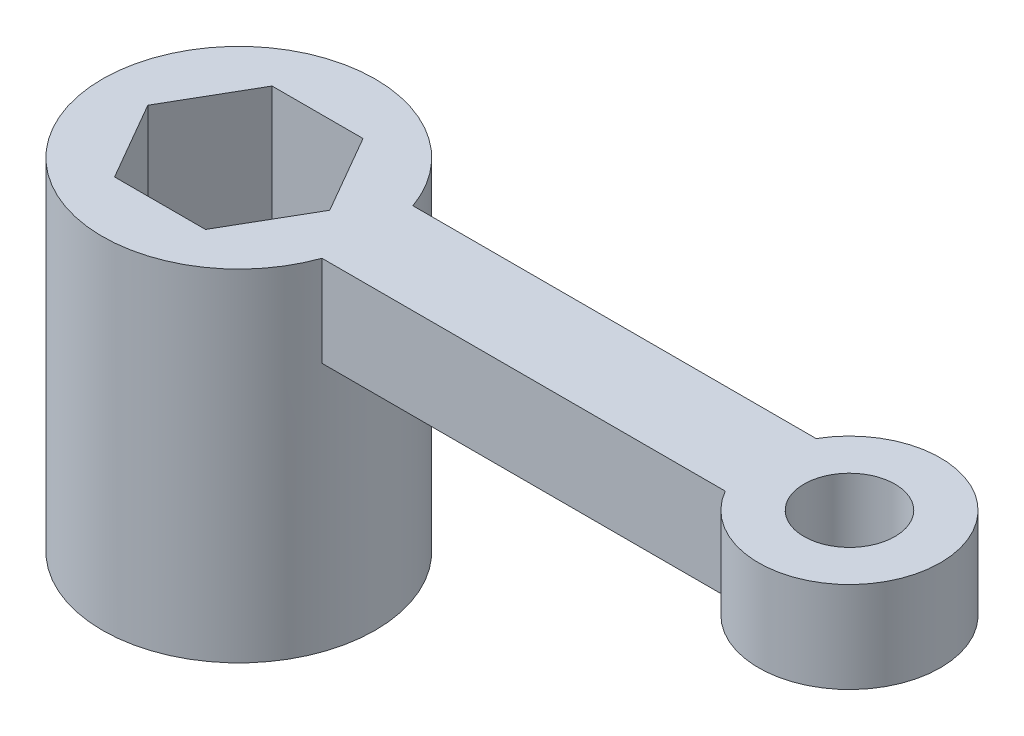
ISO-10303-21;
HEADER;
FILE_DESCRIPTION(('STEP AP214'),'2;1');
FILE_NAME('part.step','',(''),(''),'','','');
FILE_SCHEMA(('AUTOMOTIVE_DESIGN { 1 0 10303 214 1 1 1 1 }'));
ENDSEC;
DATA;
#1=APPLICATION_CONTEXT('core data for automotive mechanical design processes');
#2=APPLICATION_PROTOCOL_DEFINITION('international standard','automotive_design',2000,#1);
#3=PRODUCT_CONTEXT('',#1,'mechanical');
#4=PRODUCT('Part','Part','',(#3));
#5=PRODUCT_RELATED_PRODUCT_CATEGORY('part','',(#4));
#6=PRODUCT_DEFINITION_FORMATION('','',#4);
#7=PRODUCT_DEFINITION_CONTEXT('part definition',#1,'design');
#8=PRODUCT_DEFINITION('design','',#6,#7);
#9=PRODUCT_DEFINITION_SHAPE('','',#8);
#10=(LENGTH_UNIT() NAMED_UNIT(*) SI_UNIT(.MILLI.,.METRE.));
#11=(NAMED_UNIT(*) PLANE_ANGLE_UNIT() SI_UNIT($,.RADIAN.));
#12=(NAMED_UNIT(*) SI_UNIT($,.STERADIAN.) SOLID_ANGLE_UNIT());
#13=UNCERTAINTY_MEASURE_WITH_UNIT(LENGTH_MEASURE(1.E-05),#10,'distance_accuracy_value','');
#14=(GEOMETRIC_REPRESENTATION_CONTEXT(3) GLOBAL_UNCERTAINTY_ASSIGNED_CONTEXT((#13)) GLOBAL_UNIT_ASSIGNED_CONTEXT((#10,
#11,#12)) REPRESENTATION_CONTEXT('',''));
#15=CARTESIAN_POINT('',(0.,0.,0.));
#16=DIRECTION('',(0.,0.,1.));
#17=DIRECTION('',(1.,0.,0.));
#18=AXIS2_PLACEMENT_3D('',#15,#16,#17);
#19=CARTESIAN_POINT('',(0.,0.,0.));
#20=DIRECTION('',(0.,1.,0.));
#21=DIRECTION('',(0.,0.,1.));
#22=AXIS2_PLACEMENT_3D('',#19,#20,#21);
#23=PLANE('',#22);
#24=CARTESIAN_POINT('',(6.71434916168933,0.,0.));
#25=DIRECTION('',(0.,1.,0.));
#26=DIRECTION('',(0.,0.,1.));
#27=AXIS2_PLACEMENT_3D('',#24,#25,#26);
#28=CIRCLE('',#27,0.500000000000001);
#29=CARTESIAN_POINT('',(6.71434916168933,0.,0.500000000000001));
#30=VERTEX_POINT('',#29);
#31=EDGE_CURVE('E124',#30,#30,#28,.T.);
#32=ORIENTED_EDGE('',*,*,#31,.T.);
#33=EDGE_LOOP('',(#32));
#34=FACE_BOUND('',#33,.T.);
#35=CARTESIAN_POINT('',(0.,0.,0.));
#36=DIRECTION('',(0.,-1.,0.));
#37=DIRECTION('',(0.,0.,-1.));
#38=AXIS2_PLACEMENT_3D('',#35,#36,#37);
#39=CIRCLE('',#38,1.5);
#40=CARTESIAN_POINT('',(1.4142135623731,0.,-0.5));
#41=VERTEX_POINT('',#40);
#42=CARTESIAN_POINT('',(1.41421356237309,0.,0.5));
#43=VERTEX_POINT('',#42);
#44=EDGE_CURVE('E72',#41,#43,#39,.T.);
#45=ORIENTED_EDGE('',*,*,#44,.F.);
#46=DIRECTION('',(-1.,0.,0.));
#47=VECTOR('',#46,1.);
#48=CARTESIAN_POINT('',(0.,0.,-0.5));
#49=LINE('',#48,#47);
#50=CARTESIAN_POINT('',(5.8483237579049,0.,-0.5));
#51=VERTEX_POINT('',#50);
#52=EDGE_CURVE('E129',#51,#41,#49,.T.);
#53=ORIENTED_EDGE('',*,*,#52,.F.);
#54=CARTESIAN_POINT('',(6.71434916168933,0.,0.));
#55=DIRECTION('',(0.,1.,0.));
#56=DIRECTION('',(0.,0.,1.));
#57=AXIS2_PLACEMENT_3D('',#54,#55,#56);
#58=CIRCLE('',#57,1.);
#59=CARTESIAN_POINT('',(5.8483237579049,0.,0.5));
#60=VERTEX_POINT('',#59);
#61=EDGE_CURVE('E65',#60,#51,#58,.T.);
#62=ORIENTED_EDGE('',*,*,#61,.F.);
#63=DIRECTION('',(1.,0.,0.));
#64=VECTOR('',#63,1.);
#65=CARTESIAN_POINT('',(0.,0.,0.5));
#66=LINE('',#65,#64);
#67=EDGE_CURVE('E127',#43,#60,#66,.T.);
#68=ORIENTED_EDGE('',*,*,#67,.F.);
#69=EDGE_LOOP('',(#45,#53,#62,#68));
#70=FACE_BOUND('',#69,.T.);
#71=ADVANCED_FACE('F33',(#34,#70),#23,.F.);
#72=CARTESIAN_POINT('',(0.,1.,0.5));
#73=DIRECTION('',(0.,0.,-1.));
#74=DIRECTION('',(-1.,0.,0.));
#75=AXIS2_PLACEMENT_3D('',#72,#73,#74);
#76=PLANE('',#75);
#77=ORIENTED_EDGE('',*,*,#67,.T.);
#78=DIRECTION('',(0.,-1.,0.));
#79=VECTOR('',#78,1.);
#80=CARTESIAN_POINT('',(5.8483237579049,1.,0.5));
#81=LINE('',#80,#79);
#82=CARTESIAN_POINT('',(5.8483237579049,1.,0.5));
#83=VERTEX_POINT('',#82);
#84=EDGE_CURVE('E11',#83,#60,#81,.T.);
#85=ORIENTED_EDGE('',*,*,#84,.F.);
#86=DIRECTION('',(1.,0.,0.));
#87=VECTOR('',#86,1.);
#88=CARTESIAN_POINT('',(0.,1.,0.5));
#89=LINE('',#88,#87);
#90=CARTESIAN_POINT('',(1.41421356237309,1.,0.5));
#91=VERTEX_POINT('',#90);
#92=EDGE_CURVE('E109',#91,#83,#89,.T.);
#93=ORIENTED_EDGE('',*,*,#92,.F.);
#94=DIRECTION('',(0.,-1.,0.));
#95=VECTOR('',#94,1.);
#96=CARTESIAN_POINT('',(1.41421356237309,1.,0.5));
#97=LINE('',#96,#95);
#98=EDGE_CURVE('E146',#91,#43,#97,.T.);
#99=ORIENTED_EDGE('',*,*,#98,.T.);
#100=EDGE_LOOP('',(#77,#85,#93,#99));
#101=FACE_BOUND('',#100,.T.);
#102=ADVANCED_FACE('F196',(#101),#76,.F.);
#103=CARTESIAN_POINT('',(6.71434916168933,1.,0.));
#104=DIRECTION('',(0.,-1.,0.));
#105=DIRECTION('',(0.,0.,-1.));
#106=AXIS2_PLACEMENT_3D('',#103,#104,#105);
#107=CYLINDRICAL_SURFACE('',#106,1.);
#108=ORIENTED_EDGE('',*,*,#61,.T.);
#109=DIRECTION('',(0.,-1.,0.));
#110=VECTOR('',#109,1.);
#111=CARTESIAN_POINT('',(5.8483237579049,1.,-0.5));
#112=LINE('',#111,#110);
#113=CARTESIAN_POINT('',(5.8483237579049,1.,-0.5));
#114=VERTEX_POINT('',#113);
#115=EDGE_CURVE('E43',#114,#51,#112,.T.);
#116=ORIENTED_EDGE('',*,*,#115,.F.);
#117=CARTESIAN_POINT('',(6.71434916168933,1.,0.));
#118=DIRECTION('',(0.,1.,0.));
#119=DIRECTION('',(0.,0.,1.));
#120=AXIS2_PLACEMENT_3D('',#117,#118,#119);
#121=CIRCLE('',#120,1.);
#122=EDGE_CURVE('E103',#83,#114,#121,.T.);
#123=ORIENTED_EDGE('',*,*,#122,.F.);
#124=ORIENTED_EDGE('',*,*,#84,.T.);
#125=EDGE_LOOP('',(#108,#116,#123,#124));
#126=FACE_BOUND('',#125,.T.);
#127=ADVANCED_FACE('F112',(#126),#107,.T.);
#128=CARTESIAN_POINT('',(0.,1.,-0.5));
#129=DIRECTION('',(0.,0.,1.));
#130=DIRECTION('',(1.,0.,0.));
#131=AXIS2_PLACEMENT_3D('',#128,#129,#130);
#132=PLANE('',#131);
#133=ORIENTED_EDGE('',*,*,#52,.T.);
#134=DIRECTION('',(0.,-1.,0.));
#135=VECTOR('',#134,1.);
#136=CARTESIAN_POINT('',(1.41421356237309,1.,-0.5));
#137=LINE('',#136,#135);
#138=CARTESIAN_POINT('',(1.41421356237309,1.,-0.5));
#139=VERTEX_POINT('',#138);
#140=EDGE_CURVE('E116',#139,#41,#137,.T.);
#141=ORIENTED_EDGE('',*,*,#140,.F.);
#142=DIRECTION('',(-1.,0.,0.));
#143=VECTOR('',#142,1.);
#144=CARTESIAN_POINT('',(0.,1.,-0.5));
#145=LINE('',#144,#143);
#146=EDGE_CURVE('E106',#114,#139,#145,.T.);
#147=ORIENTED_EDGE('',*,*,#146,.F.);
#148=ORIENTED_EDGE('',*,*,#115,.T.);
#149=EDGE_LOOP('',(#133,#141,#147,#148));
#150=FACE_BOUND('',#149,.T.);
#151=ADVANCED_FACE('F118',(#150),#132,.F.);
#152=CARTESIAN_POINT('',(0.75,1.,0.433012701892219));
#153=DIRECTION('',(-0.866025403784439,0.,-0.5));
#154=DIRECTION('',(-0.5,0.,0.866025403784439));
#155=AXIS2_PLACEMENT_3D('',#152,#153,#154);
#156=PLANE('',#155);
#157=DIRECTION('',(0.,-1.,0.));
#158=VECTOR('',#157,1.);
#159=CARTESIAN_POINT('',(1.,1.,0.));
#160=LINE('',#159,#158);
#161=CARTESIAN_POINT('',(1.,1.,0.));
#162=VERTEX_POINT('',#161);
#163=CARTESIAN_POINT('',(1.,-2.75,0.));
#164=VERTEX_POINT('',#163);
#165=EDGE_CURVE('E120',#162,#164,#160,.T.);
#166=ORIENTED_EDGE('',*,*,#165,.T.);
#167=DIRECTION('',(-0.5,0.,0.866025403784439));
#168=VECTOR('',#167,1.);
#169=CARTESIAN_POINT('',(0.5,-2.75,0.866025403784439));
#170=LINE('',#169,#168);
#171=CARTESIAN_POINT('',(0.5,-2.75,0.866025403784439));
#172=VERTEX_POINT('',#171);
#173=EDGE_CURVE('E239',#164,#172,#170,.T.);
#174=ORIENTED_EDGE('',*,*,#173,.T.);
#175=DIRECTION('',(0.,-1.,0.));
#176=VECTOR('',#175,1.);
#177=CARTESIAN_POINT('',(0.5,1.,0.866025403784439));
#178=LINE('',#177,#176);
#179=CARTESIAN_POINT('',(0.5,1.,0.866025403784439));
#180=VERTEX_POINT('',#179);
#181=EDGE_CURVE('E81',#180,#172,#178,.T.);
#182=ORIENTED_EDGE('',*,*,#181,.F.);
#183=DIRECTION('',(0.5,0.,-0.866025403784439));
#184=VECTOR('',#183,1.);
#185=CARTESIAN_POINT('',(0.75,1.,0.433012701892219));
#186=LINE('',#185,#184);
#187=EDGE_CURVE('E155',#180,#162,#186,.T.);
#188=ORIENTED_EDGE('',*,*,#187,.T.);
#189=EDGE_LOOP('',(#166,#174,#182,#188));
#190=FACE_BOUND('',#189,.T.);
#191=ADVANCED_FACE('F35',(#190),#156,.T.);
#192=CARTESIAN_POINT('',(0.,1.,0.866025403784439));
#193=DIRECTION('',(0.,0.,-1.));
#194=DIRECTION('',(-1.,0.,0.));
#195=AXIS2_PLACEMENT_3D('',#192,#193,#194);
#196=PLANE('',#195);
#197=ORIENTED_EDGE('',*,*,#181,.T.);
#198=DIRECTION('',(-1.,0.,0.));
#199=VECTOR('',#198,1.);
#200=CARTESIAN_POINT('',(-0.5,-2.75,0.866025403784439));
#201=LINE('',#200,#199);
#202=CARTESIAN_POINT('',(-0.5,-2.75,0.866025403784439));
#203=VERTEX_POINT('',#202);
#204=EDGE_CURVE('E234',#172,#203,#201,.T.);
#205=ORIENTED_EDGE('',*,*,#204,.T.);
#206=DIRECTION('',(0.,-1.,0.));
#207=VECTOR('',#206,1.);
#208=CARTESIAN_POINT('',(-0.5,1.,0.866025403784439));
#209=LINE('',#208,#207);
#210=CARTESIAN_POINT('',(-0.5,1.,0.866025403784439));
#211=VERTEX_POINT('',#210);
#212=EDGE_CURVE('E142',#211,#203,#209,.T.);
#213=ORIENTED_EDGE('',*,*,#212,.F.);
#214=DIRECTION('',(1.,0.,0.));
#215=VECTOR('',#214,1.);
#216=CARTESIAN_POINT('',(0.,1.,0.866025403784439));
#217=LINE('',#216,#215);
#218=EDGE_CURVE('E157',#211,#180,#217,.T.);
#219=ORIENTED_EDGE('',*,*,#218,.T.);
#220=EDGE_LOOP('',(#197,#205,#213,#219));
#221=FACE_BOUND('',#220,.T.);
#222=ADVANCED_FACE('F223',(#221),#196,.T.);
#223=CARTESIAN_POINT('',(-0.75,1.,0.43301270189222));
#224=DIRECTION('',(0.866025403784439,0.,-0.5));
#225=DIRECTION('',(-0.5,0.,-0.866025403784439));
#226=AXIS2_PLACEMENT_3D('',#223,#224,#225);
#227=PLANE('',#226);
#228=ORIENTED_EDGE('',*,*,#212,.T.);
#229=DIRECTION('',(-0.5,0.,-0.866025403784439));
#230=VECTOR('',#229,1.);
#231=CARTESIAN_POINT('',(-1.,-2.75,0.));
#232=LINE('',#231,#230);
#233=CARTESIAN_POINT('',(-1.,-2.75,0.));
#234=VERTEX_POINT('',#233);
#235=EDGE_CURVE('E247',#203,#234,#232,.T.);
#236=ORIENTED_EDGE('',*,*,#235,.T.);
#237=DIRECTION('',(0.,-1.,0.));
#238=VECTOR('',#237,1.);
#239=CARTESIAN_POINT('',(-1.,1.,0.));
#240=LINE('',#239,#238);
#241=CARTESIAN_POINT('',(-1.,1.,0.));
#242=VERTEX_POINT('',#241);
#243=EDGE_CURVE('E139',#242,#234,#240,.T.);
#244=ORIENTED_EDGE('',*,*,#243,.F.);
#245=DIRECTION('',(0.5,0.,0.866025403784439));
#246=VECTOR('',#245,1.);
#247=CARTESIAN_POINT('',(-0.75,1.,0.43301270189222));
#248=LINE('',#247,#246);
#249=EDGE_CURVE('E160',#242,#211,#248,.T.);
#250=ORIENTED_EDGE('',*,*,#249,.T.);
#251=EDGE_LOOP('',(#228,#236,#244,#250));
#252=FACE_BOUND('',#251,.T.);
#253=ADVANCED_FACE('F220',(#252),#227,.T.);
#254=CARTESIAN_POINT('',(-0.75,1.,-0.43301270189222));
#255=DIRECTION('',(0.866025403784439,0.,0.5));
#256=DIRECTION('',(0.5,0.,-0.866025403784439));
#257=AXIS2_PLACEMENT_3D('',#254,#255,#256);
#258=PLANE('',#257);
#259=ORIENTED_EDGE('',*,*,#243,.T.);
#260=DIRECTION('',(0.5,0.,-0.866025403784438));
#261=VECTOR('',#260,1.);
#262=CARTESIAN_POINT('',(-0.5,-2.75,-0.866025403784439));
#263=LINE('',#262,#261);
#264=CARTESIAN_POINT('',(-0.5,-2.75,-0.866025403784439));
#265=VERTEX_POINT('',#264);
#266=EDGE_CURVE('E249',#234,#265,#263,.T.);
#267=ORIENTED_EDGE('',*,*,#266,.T.);
#268=DIRECTION('',(0.,-1.,0.));
#269=VECTOR('',#268,1.);
#270=CARTESIAN_POINT('',(-0.5,1.,-0.866025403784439));
#271=LINE('',#270,#269);
#272=CARTESIAN_POINT('',(-0.5,1.,-0.866025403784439));
#273=VERTEX_POINT('',#272);
#274=EDGE_CURVE('E136',#273,#265,#271,.T.);
#275=ORIENTED_EDGE('',*,*,#274,.F.);
#276=DIRECTION('',(-0.5,0.,0.866025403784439));
#277=VECTOR('',#276,1.);
#278=CARTESIAN_POINT('',(-0.75,1.,-0.43301270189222));
#279=LINE('',#278,#277);
#280=EDGE_CURVE('E163',#273,#242,#279,.T.);
#281=ORIENTED_EDGE('',*,*,#280,.T.);
#282=EDGE_LOOP('',(#259,#267,#275,#281));
#283=FACE_BOUND('',#282,.T.);
#284=ADVANCED_FACE('F216',(#283),#258,.T.);
#285=CARTESIAN_POINT('',(0.,1.,-0.866025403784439));
#286=DIRECTION('',(0.,0.,1.));
#287=DIRECTION('',(1.,0.,0.));
#288=AXIS2_PLACEMENT_3D('',#285,#286,#287);
#289=PLANE('',#288);
#290=ORIENTED_EDGE('',*,*,#274,.T.);
#291=DIRECTION('',(1.,0.,0.));
#292=VECTOR('',#291,1.);
#293=CARTESIAN_POINT('',(0.5,-2.75,-0.866025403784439));
#294=LINE('',#293,#292);
#295=CARTESIAN_POINT('',(0.5,-2.75,-0.866025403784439));
#296=VERTEX_POINT('',#295);
#297=EDGE_CURVE('E254',#265,#296,#294,.T.);
#298=ORIENTED_EDGE('',*,*,#297,.T.);
#299=DIRECTION('',(0.,-1.,0.));
#300=VECTOR('',#299,1.);
#301=CARTESIAN_POINT('',(0.5,1.,-0.866025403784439));
#302=LINE('',#301,#300);
#303=CARTESIAN_POINT('',(0.5,1.,-0.866025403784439));
#304=VERTEX_POINT('',#303);
#305=EDGE_CURVE('E133',#304,#296,#302,.T.);
#306=ORIENTED_EDGE('',*,*,#305,.F.);
#307=DIRECTION('',(-1.,0.,0.));
#308=VECTOR('',#307,1.);
#309=CARTESIAN_POINT('',(0.,1.,-0.866025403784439));
#310=LINE('',#309,#308);
#311=EDGE_CURVE('E166',#304,#273,#310,.T.);
#312=ORIENTED_EDGE('',*,*,#311,.T.);
#313=EDGE_LOOP('',(#290,#298,#306,#312));
#314=FACE_BOUND('',#313,.T.);
#315=ADVANCED_FACE('F210',(#314),#289,.T.);
#316=CARTESIAN_POINT('',(6.71434916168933,1.,0.));
#317=DIRECTION('',(0.,-1.,0.));
#318=DIRECTION('',(0.,0.,-1.));
#319=AXIS2_PLACEMENT_3D('',#316,#317,#318);
#320=CYLINDRICAL_SURFACE('',#319,0.500000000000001);
#321=CARTESIAN_POINT('',(6.71434916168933,1.,0.));
#322=DIRECTION('',(0.,1.,0.));
#323=DIRECTION('',(0.,0.,1.));
#324=AXIS2_PLACEMENT_3D('',#321,#322,#323);
#325=CIRCLE('',#324,0.500000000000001);
#326=CARTESIAN_POINT('',(6.71434916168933,1.,0.500000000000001));
#327=VERTEX_POINT('',#326);
#328=EDGE_CURVE('E172',#327,#327,#325,.T.);
#329=ORIENTED_EDGE('',*,*,#328,.T.);
#330=EDGE_LOOP('',(#329));
#331=FACE_BOUND('',#330,.T.);
#332=ORIENTED_EDGE('',*,*,#31,.F.);
#333=EDGE_LOOP('',(#332));
#334=FACE_BOUND('',#333,.T.);
#335=ADVANCED_FACE('F176',(#331,#334),#320,.F.);
#336=CARTESIAN_POINT('',(0.75,1.,-0.433012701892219));
#337=DIRECTION('',(-0.866025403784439,0.,0.5));
#338=DIRECTION('',(0.5,0.,0.866025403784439));
#339=AXIS2_PLACEMENT_3D('',#336,#337,#338);
#340=PLANE('',#339);
#341=ORIENTED_EDGE('',*,*,#305,.T.);
#342=DIRECTION('',(0.5,0.,0.866025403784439));
#343=VECTOR('',#342,1.);
#344=CARTESIAN_POINT('',(1.,-2.75,0.));
#345=LINE('',#344,#343);
#346=EDGE_CURVE('E153',#296,#164,#345,.T.);
#347=ORIENTED_EDGE('',*,*,#346,.T.);
#348=ORIENTED_EDGE('',*,*,#165,.F.);
#349=DIRECTION('',(-0.5,0.,-0.866025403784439));
#350=VECTOR('',#349,1.);
#351=CARTESIAN_POINT('',(0.75,1.,-0.433012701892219));
#352=LINE('',#351,#350);
#353=EDGE_CURVE('E169',#162,#304,#352,.T.);
#354=ORIENTED_EDGE('',*,*,#353,.T.);
#355=EDGE_LOOP('',(#341,#347,#348,#354));
#356=FACE_BOUND('',#355,.T.);
#357=ADVANCED_FACE('F192',(#356),#340,.T.);
#358=CARTESIAN_POINT('',(0.,1.,0.));
#359=DIRECTION('',(0.,-1.,0.));
#360=DIRECTION('',(0.,0.,-1.));
#361=AXIS2_PLACEMENT_3D('',#358,#359,#360);
#362=CYLINDRICAL_SURFACE('',#361,1.5);
#363=ORIENTED_EDGE('',*,*,#140,.T.);
#364=ORIENTED_EDGE('',*,*,#44,.T.);
#365=ORIENTED_EDGE('',*,*,#98,.F.);
#366=CARTESIAN_POINT('',(0.,1.,0.));
#367=DIRECTION('',(0.,1.,0.));
#368=DIRECTION('',(0.,0.,1.));
#369=AXIS2_PLACEMENT_3D('',#366,#367,#368);
#370=CIRCLE('',#369,1.5);
#371=EDGE_CURVE('E52',#139,#91,#370,.T.);
#372=ORIENTED_EDGE('',*,*,#371,.F.);
#373=EDGE_LOOP('',(#363,#364,#365,#372));
#374=FACE_BOUND('',#373,.T.);
#375=CARTESIAN_POINT('',(0.,-2.75,0.));
#376=DIRECTION('',(0.,-1.,0.));
#377=DIRECTION('',(0.,0.,-1.));
#378=AXIS2_PLACEMENT_3D('',#375,#376,#377);
#379=CIRCLE('',#378,1.5);
#380=CARTESIAN_POINT('',(0.,-2.75,-1.5));
#381=VERTEX_POINT('',#380);
#382=EDGE_CURVE('E128',#381,#381,#379,.T.);
#383=ORIENTED_EDGE('',*,*,#382,.F.);
#384=EDGE_LOOP('',(#383));
#385=FACE_BOUND('',#384,.T.);
#386=ADVANCED_FACE('F181',(#374,#385),#362,.T.);
#387=CARTESIAN_POINT('',(0.,1.,0.));
#388=DIRECTION('',(0.,1.,0.));
#389=DIRECTION('',(0.,0.,1.));
#390=AXIS2_PLACEMENT_3D('',#387,#388,#389);
#391=PLANE('',#390);
#392=ORIENTED_EDGE('',*,*,#187,.F.);
#393=ORIENTED_EDGE('',*,*,#218,.F.);
#394=ORIENTED_EDGE('',*,*,#249,.F.);
#395=ORIENTED_EDGE('',*,*,#280,.F.);
#396=ORIENTED_EDGE('',*,*,#311,.F.);
#397=ORIENTED_EDGE('',*,*,#353,.F.);
#398=EDGE_LOOP('',(#392,#393,#394,#395,#396,#397));
#399=FACE_BOUND('',#398,.T.);
#400=ORIENTED_EDGE('',*,*,#328,.F.);
#401=EDGE_LOOP('',(#400));
#402=FACE_BOUND('',#401,.T.);
#403=ORIENTED_EDGE('',*,*,#92,.T.);
#404=ORIENTED_EDGE('',*,*,#122,.T.);
#405=ORIENTED_EDGE('',*,*,#146,.T.);
#406=ORIENTED_EDGE('',*,*,#371,.T.);
#407=EDGE_LOOP('',(#403,#404,#405,#406));
#408=FACE_BOUND('',#407,.T.);
#409=ADVANCED_FACE('F104',(#399,#402,#408),#391,.T.);
#410=CARTESIAN_POINT('',(0.,-2.75,0.));
#411=DIRECTION('',(0.,-1.,0.));
#412=DIRECTION('',(0.,0.,-1.));
#413=AXIS2_PLACEMENT_3D('',#410,#411,#412);
#414=PLANE('',#413);
#415=ORIENTED_EDGE('',*,*,#382,.T.);
#416=EDGE_LOOP('',(#415));
#417=FACE_BOUND('',#416,.T.);
#418=ORIENTED_EDGE('',*,*,#204,.F.);
#419=ORIENTED_EDGE('',*,*,#173,.F.);
#420=ORIENTED_EDGE('',*,*,#346,.F.);
#421=ORIENTED_EDGE('',*,*,#297,.F.);
#422=ORIENTED_EDGE('',*,*,#266,.F.);
#423=ORIENTED_EDGE('',*,*,#235,.F.);
#424=EDGE_LOOP('',(#418,#419,#420,#421,#422,#423));
#425=FACE_BOUND('',#424,.T.);
#426=ADVANCED_FACE('F180',(#417,#425),#414,.T.);
#427=CLOSED_SHELL('',(#71,#102,#127,#151,#191,#222,#253,#284,#315,#335,#357,#386,#409,#426));
#428=MANIFOLD_SOLID_BREP('B2',#427);
#429=ADVANCED_BREP_SHAPE_REPRESENTATION('',(#18,#428),#14);
#430=SHAPE_DEFINITION_REPRESENTATION(#9,#429);
ENDSEC;
END-ISO-10303-21;
